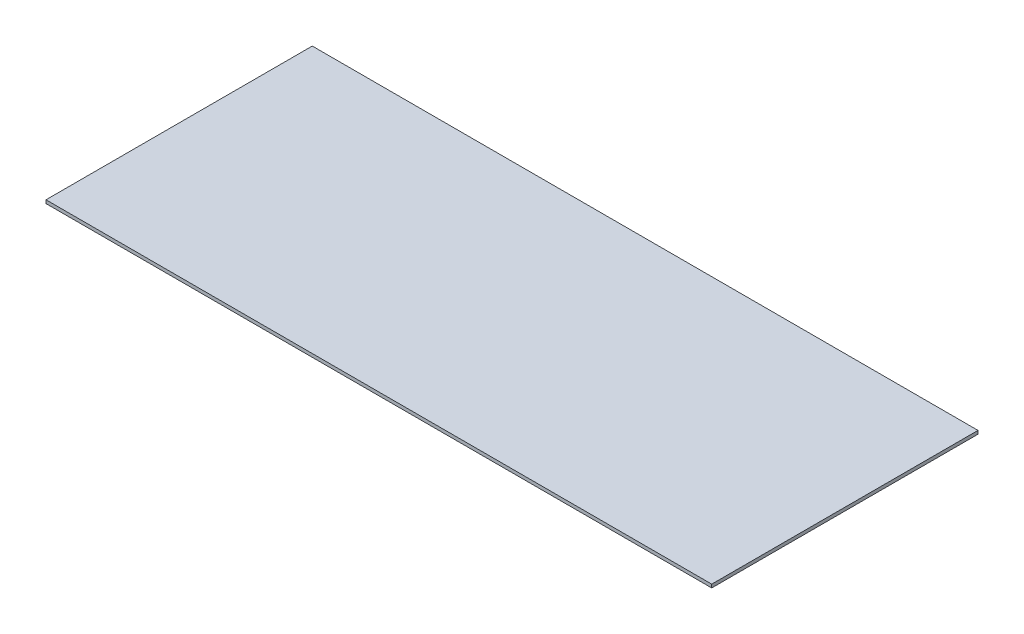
from build123d import *

# Parameters (mm, degrees)
ESQUISSE1_W      = 2000
ESQUISSE1_H      = 10
EXTRUSION1_DEPTH = 800


with BuildPart() as part:
    # Esquisse1 → Extrusion1 (new body)
    with BuildSketch(Plane.XY):
        with Locations((-1000, 5)):
            Rectangle(ESQUISSE1_W, ESQUISSE1_H)
    extrude(amount=EXTRUSION1_DEPTH)


solid = part.part
